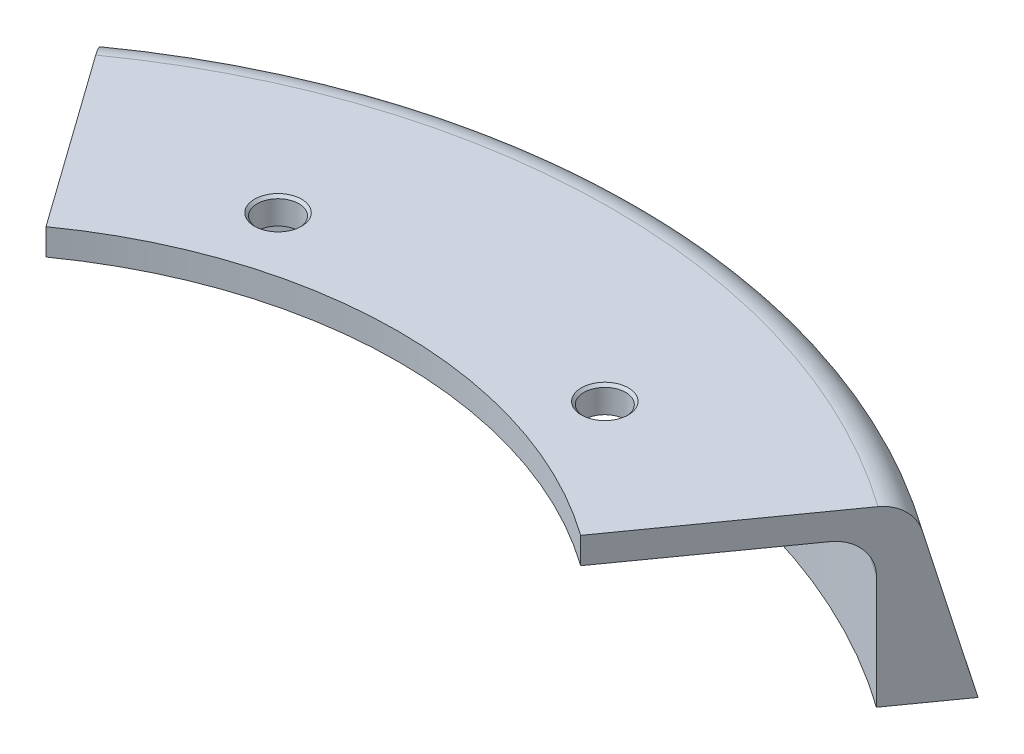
from build123d import *

# Parameters (mm, degrees)
REVOLVE1_ANGLE                    = 71
F_3_8_CLEARANCE_HOLE1_D           = 10.0838
F_3_8_CLEARANCE_HOLE1_CSINK_D     = 11.3538
F_3_8_CLEARANCE_HOLE1_CSINK_ANGLE = 90
SHELL1_T                          = -6.35
RIB5_REACH                        = 213.034
SKETCH5_WALL_W                    = 428.723644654
SKETCH5_WALL_H                    = 6.35
FILLET2_R                         = 7.9375


with BuildPart() as part:
    # Sketch1 → Revolve1 (revolve, symmetric)
    with BuildSketch(Plane(origin=(0, 0, 0), x_dir=(0, 0, -1), z_dir=(1, 0, 0))) as revolve1_sk:
        Polygon((111.125, 6.35), (111.125, 0), (162.306, 0), (162.306, -35.56), (179.885750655, -35.56), (168.656, 6.35), align=None)
    revolve(axis=Axis((0, -1842.898977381, 0), (0, 1, 0)), revolution_arc=REVOLVE1_ANGLE / 2)
    revolve(revolve1_sk.sketch, axis=Axis((0, -1842.898977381, 0), (0, -1, 0)), revolution_arc=REVOLVE1_ANGLE / 2)

    # 3_8 Clearance Hole1 (through all)
    with Locations(Plane(origin=(0, 6.35, 0), x_dir=(1, 0, 0), z_dir=(0, 1, 0))):
        with Locations((-39.441384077, 121.388098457)):
            f_3_8_clearance_hole1 = CounterSinkHole(F_3_8_CLEARANCE_HOLE1_D / 2, F_3_8_CLEARANCE_HOLE1_CSINK_D / 2, counter_sink_angle=F_3_8_CLEARANCE_HOLE1_CSINK_ANGLE)

    # Mirror1: 3_8 Clearance Hole1 across plane
    add(f_3_8_clearance_hole1.mirror(Plane(origin=(0, 0, 0), x_dir=(0, 0, 1), z_dir=(1, 0, 0))), mode=Mode.SUBTRACT)

    # Shell1
    shell1_openings = [part.faces().sort_by_distance(p)[0] for p in [
        (0, -35.56, -164.449076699),
    ]]
    offset(amount=SHELL1_T, openings=shell1_openings, kind=Kind.INTERSECTION)

    # Sketch5 wall → Rib5 (add, up to next)
    with BuildSketch(Plane(origin=(0, -35.56, -170.983873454), x_dir=(0, 0, -1), z_dir=(0, 1, 0)), mode=Mode.PRIVATE) as rib5_sk1:
        Rectangle(SKETCH5_WALL_W, SKETCH5_WALL_H)
    rib5_tool1 = extrude(rib5_sk1.sketch, amount=RIB5_REACH, mode=Mode.PRIVATE) - part.part
    add(rib5_tool1.solids().sort_by_distance((0, -35.56, -170.983873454))[0])

    # Fillet2
    fillet2_edges = [part.edges().sort_by_distance(p)[0] for p in [
        (0, 6.35, -168.656),
        (0, 0, -162.306),
    ]]
    fillet(fillet2_edges, radius=FILLET2_R)


solid = part.part
